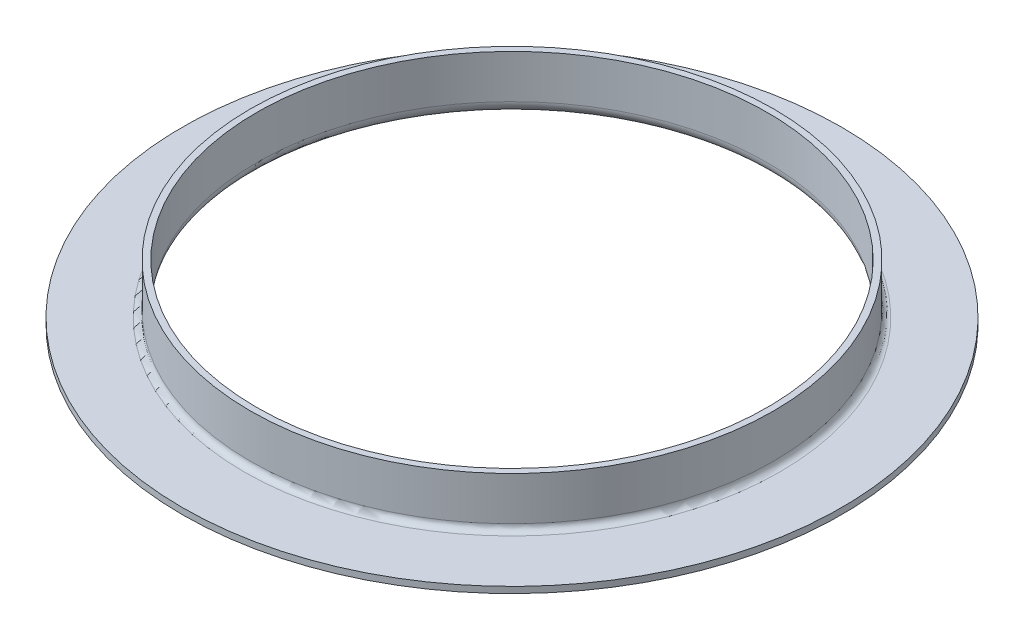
ISO-10303-21;
HEADER;
FILE_DESCRIPTION(('STEP AP214'),'2;1');
FILE_NAME('part.step','',(''),(''),'','','');
FILE_SCHEMA(('AUTOMOTIVE_DESIGN { 1 0 10303 214 1 1 1 1 }'));
ENDSEC;
DATA;
#1=APPLICATION_CONTEXT('core data for automotive mechanical design processes');
#2=APPLICATION_PROTOCOL_DEFINITION('international standard','automotive_design',2000,#1);
#3=PRODUCT_CONTEXT('',#1,'mechanical');
#4=PRODUCT('Part','Part','',(#3));
#5=PRODUCT_RELATED_PRODUCT_CATEGORY('part','',(#4));
#6=PRODUCT_DEFINITION_FORMATION('','',#4);
#7=PRODUCT_DEFINITION_CONTEXT('part definition',#1,'design');
#8=PRODUCT_DEFINITION('design','',#6,#7);
#9=PRODUCT_DEFINITION_SHAPE('','',#8);
#10=(LENGTH_UNIT() NAMED_UNIT(*) SI_UNIT(.MILLI.,.METRE.));
#11=(NAMED_UNIT(*) PLANE_ANGLE_UNIT() SI_UNIT($,.RADIAN.));
#12=(NAMED_UNIT(*) SI_UNIT($,.STERADIAN.) SOLID_ANGLE_UNIT());
#13=UNCERTAINTY_MEASURE_WITH_UNIT(LENGTH_MEASURE(1.E-05),#10,'distance_accuracy_value','');
#14=(GEOMETRIC_REPRESENTATION_CONTEXT(3) GLOBAL_UNCERTAINTY_ASSIGNED_CONTEXT((#13)) GLOBAL_UNIT_ASSIGNED_CONTEXT((#10,
#11,#12)) REPRESENTATION_CONTEXT('',''));
#15=CARTESIAN_POINT('',(0.,0.,0.));
#16=DIRECTION('',(0.,0.,1.));
#17=DIRECTION('',(1.,0.,0.));
#18=AXIS2_PLACEMENT_3D('',#15,#16,#17);
#19=CARTESIAN_POINT('',(0.,11.,0.));
#20=DIRECTION('',(0.,1.,0.));
#21=DIRECTION('',(0.,0.,1.));
#22=AXIS2_PLACEMENT_3D('',#19,#20,#21);
#23=CYLINDRICAL_SURFACE('',#22,82.15);
#24=CARTESIAN_POINT('',(0.,18.,0.));
#25=DIRECTION('',(0.,1.,0.));
#26=DIRECTION('',(0.,0.,1.));
#27=AXIS2_PLACEMENT_3D('',#24,#25,#26);
#28=CIRCLE('',#27,82.15);
#29=CARTESIAN_POINT('',(0.,18.,82.15));
#30=VERTEX_POINT('',#29);
#31=EDGE_CURVE('E19',#30,#30,#28,.F.);
#32=ORIENTED_EDGE('',*,*,#31,.F.);
#33=EDGE_LOOP('',(#32));
#34=FACE_BOUND('',#33,.T.);
#35=CARTESIAN_POINT('',(0.,4.,0.));
#36=DIRECTION('',(0.,1.,0.));
#37=DIRECTION('',(0.,0.,1.));
#38=AXIS2_PLACEMENT_3D('',#35,#36,#37);
#39=CIRCLE('',#38,82.15);
#40=CARTESIAN_POINT('',(0.,4.,82.15));
#41=VERTEX_POINT('',#40);
#42=EDGE_CURVE('E37',#41,#41,#39,.T.);
#43=ORIENTED_EDGE('',*,*,#42,.F.);
#44=EDGE_LOOP('',(#43));
#45=FACE_BOUND('',#44,.T.);
#46=ADVANCED_FACE('F16',(#34,#45),#23,.F.);
#47=CARTESIAN_POINT('',(0.,4.00000000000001,0.));
#48=DIRECTION('',(0.,1.,0.));
#49=DIRECTION('',(0.,0.,1.));
#50=AXIS2_PLACEMENT_3D('',#47,#48,#49);
#51=TOROIDAL_SURFACE('',#50,86.15,4.00000000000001);
#52=ORIENTED_EDGE('',*,*,#42,.T.);
#53=EDGE_LOOP('',(#52));
#54=FACE_BOUND('',#53,.T.);
#55=CARTESIAN_POINT('',(0.,0.,0.));
#56=DIRECTION('',(0.,-1.,0.));
#57=DIRECTION('',(0.,0.,-1.));
#58=AXIS2_PLACEMENT_3D('',#55,#56,#57);
#59=CIRCLE('',#58,86.15);
#60=CARTESIAN_POINT('',(0.,0.,-86.15));
#61=VERTEX_POINT('',#60);
#62=EDGE_CURVE('E42',#61,#61,#59,.F.);
#63=ORIENTED_EDGE('',*,*,#62,.F.);
#64=EDGE_LOOP('',(#63));
#65=FACE_BOUND('',#64,.T.);
#66=ADVANCED_FACE('F55',(#54,#65),#51,.T.);
#67=CARTESIAN_POINT('',(83.15,18.,0.));
#68=DIRECTION('',(0.,1.,0.));
#69=DIRECTION('',(0.,0.,1.));
#70=AXIS2_PLACEMENT_3D('',#67,#68,#69);
#71=PLANE('',#70);
#72=ORIENTED_EDGE('',*,*,#31,.T.);
#73=EDGE_LOOP('',(#72));
#74=FACE_BOUND('',#73,.T.);
#75=CARTESIAN_POINT('',(0.,18.,0.));
#76=DIRECTION('',(0.,1.,0.));
#77=DIRECTION('',(0.,0.,1.));
#78=AXIS2_PLACEMENT_3D('',#75,#76,#77);
#79=CIRCLE('',#78,84.15);
#80=CARTESIAN_POINT('',(0.,18.,84.15));
#81=VERTEX_POINT('',#80);
#82=EDGE_CURVE('E40',#81,#81,#79,.F.);
#83=ORIENTED_EDGE('',*,*,#82,.F.);
#84=EDGE_LOOP('',(#83));
#85=FACE_BOUND('',#84,.T.);
#86=ADVANCED_FACE('F64',(#74,#85),#71,.T.);
#87=CARTESIAN_POINT('',(96.075,0.,0.));
#88=DIRECTION('',(0.,-1.,0.));
#89=DIRECTION('',(1.,0.,0.));
#90=AXIS2_PLACEMENT_3D('',#87,#88,#89);
#91=PLANE('',#90);
#92=ORIENTED_EDGE('',*,*,#62,.T.);
#93=EDGE_LOOP('',(#92));
#94=FACE_BOUND('',#93,.T.);
#95=CARTESIAN_POINT('',(0.,0.,0.));
#96=DIRECTION('',(0.,1.,0.));
#97=DIRECTION('',(0.,0.,1.));
#98=AXIS2_PLACEMENT_3D('',#95,#96,#97);
#99=CIRCLE('',#98,106.);
#100=CARTESIAN_POINT('',(0.,0.,106.));
#101=VERTEX_POINT('',#100);
#102=EDGE_CURVE('E33',#101,#101,#99,.T.);
#103=ORIENTED_EDGE('',*,*,#102,.F.);
#104=EDGE_LOOP('',(#103));
#105=FACE_BOUND('',#104,.T.);
#106=ADVANCED_FACE('F101',(#94,#105),#91,.T.);
#107=CARTESIAN_POINT('',(0.,11.,0.));
#108=DIRECTION('',(0.,1.,0.));
#109=DIRECTION('',(0.,0.,1.));
#110=AXIS2_PLACEMENT_3D('',#107,#108,#109);
#111=CYLINDRICAL_SURFACE('',#110,84.15);
#112=ORIENTED_EDGE('',*,*,#82,.T.);
#113=EDGE_LOOP('',(#112));
#114=FACE_BOUND('',#113,.T.);
#115=CARTESIAN_POINT('',(0.,4.,0.));
#116=DIRECTION('',(0.,1.,0.));
#117=DIRECTION('',(0.,0.,1.));
#118=AXIS2_PLACEMENT_3D('',#115,#116,#117);
#119=CIRCLE('',#118,84.15);
#120=CARTESIAN_POINT('',(0.,4.,84.15));
#121=VERTEX_POINT('',#120);
#122=EDGE_CURVE('E28',#121,#121,#119,.T.);
#123=ORIENTED_EDGE('',*,*,#122,.T.);
#124=EDGE_LOOP('',(#123));
#125=FACE_BOUND('',#124,.T.);
#126=ADVANCED_FACE('F111',(#114,#125),#111,.T.);
#127=CARTESIAN_POINT('',(0.,1.,0.));
#128=DIRECTION('',(0.,1.,0.));
#129=DIRECTION('',(0.,0.,1.));
#130=AXIS2_PLACEMENT_3D('',#127,#128,#129);
#131=CYLINDRICAL_SURFACE('',#130,106.);
#132=ORIENTED_EDGE('',*,*,#102,.T.);
#133=EDGE_LOOP('',(#132));
#134=FACE_BOUND('',#133,.T.);
#135=CARTESIAN_POINT('',(0.,2.,0.));
#136=DIRECTION('',(0.,1.,0.));
#137=DIRECTION('',(0.,0.,1.));
#138=AXIS2_PLACEMENT_3D('',#135,#136,#137);
#139=CIRCLE('',#138,106.);
#140=CARTESIAN_POINT('',(0.,2.,106.));
#141=VERTEX_POINT('',#140);
#142=EDGE_CURVE('E23',#141,#141,#139,.T.);
#143=ORIENTED_EDGE('',*,*,#142,.F.);
#144=EDGE_LOOP('',(#143));
#145=FACE_BOUND('',#144,.T.);
#146=ADVANCED_FACE('F71',(#134,#145),#131,.T.);
#147=CARTESIAN_POINT('',(0.,4.00000000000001,0.));
#148=DIRECTION('',(0.,1.,0.));
#149=DIRECTION('',(0.,0.,1.));
#150=AXIS2_PLACEMENT_3D('',#147,#148,#149);
#151=TOROIDAL_SURFACE('',#150,86.15,2.00000000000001);
#152=CARTESIAN_POINT('',(0.,2.,0.));
#153=DIRECTION('',(0.,1.,0.));
#154=DIRECTION('',(1.,0.,0.));
#155=AXIS2_PLACEMENT_3D('',#152,#153,#154);
#156=CIRCLE('',#155,86.15);
#157=CARTESIAN_POINT('',(86.15,2.,0.));
#158=VERTEX_POINT('',#157);
#159=EDGE_CURVE('E10',#158,#158,#156,.F.);
#160=ORIENTED_EDGE('',*,*,#159,.F.);
#161=EDGE_LOOP('',(#160));
#162=FACE_BOUND('',#161,.T.);
#163=ORIENTED_EDGE('',*,*,#122,.F.);
#164=EDGE_LOOP('',(#163));
#165=FACE_BOUND('',#164,.T.);
#166=ADVANCED_FACE('F67',(#162,#165),#151,.F.);
#167=CARTESIAN_POINT('',(96.075,2.,0.));
#168=DIRECTION('',(0.,1.,0.));
#169=DIRECTION('',(0.,0.,1.));
#170=AXIS2_PLACEMENT_3D('',#167,#168,#169);
#171=PLANE('',#170);
#172=ORIENTED_EDGE('',*,*,#159,.T.);
#173=EDGE_LOOP('',(#172));
#174=FACE_BOUND('',#173,.T.);
#175=ORIENTED_EDGE('',*,*,#142,.T.);
#176=EDGE_LOOP('',(#175));
#177=FACE_BOUND('',#176,.T.);
#178=ADVANCED_FACE('F65',(#174,#177),#171,.T.);
#179=CLOSED_SHELL('',(#46,#66,#86,#106,#126,#146,#166,#178));
#180=MANIFOLD_SOLID_BREP('B1',#179);
#181=ADVANCED_BREP_SHAPE_REPRESENTATION('',(#18,#180),#14);
#182=SHAPE_DEFINITION_REPRESENTATION(#9,#181);
ENDSEC;
END-ISO-10303-21;
